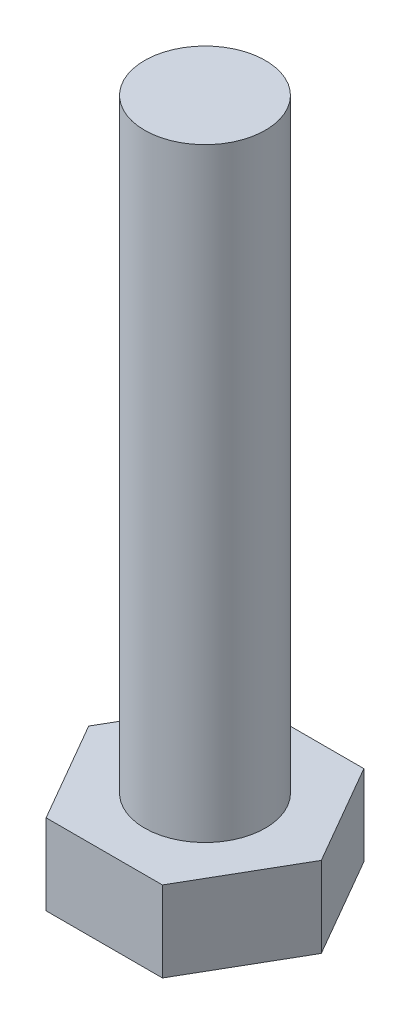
from build123d import *

# Parameters (mm, degrees)
EXTRUSION1_DEPTH = 4
ESQUISSE2_R      = 3
EXTRUSION2_DEPTH = 30


with BuildPart() as part:
    # Esquisse1 → Extrusion1 (new body)
    with BuildSketch(Plane(origin=(0, 0, 0), x_dir=(1, 0, 0), z_dir=(0, 1, 0))):
        Polygon((5.773502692, 0), (2.886751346, 5), (-2.886751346, 5), (-5.773502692, 0), (-2.886751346, -5), (2.886751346, -5), align=None)
    extrude(amount=EXTRUSION1_DEPTH)

    # Esquisse2 → Extrusion2 (add)
    with BuildSketch(Plane(origin=(0, 4, 0), x_dir=(-1, 0, 0), z_dir=(0, 1, 0))):
        with Locations(Location((0, 0, 0), (0, 0, 90))):
            Circle(ESQUISSE2_R)
    extrude(amount=EXTRUSION2_DEPTH)


solid = part.part
